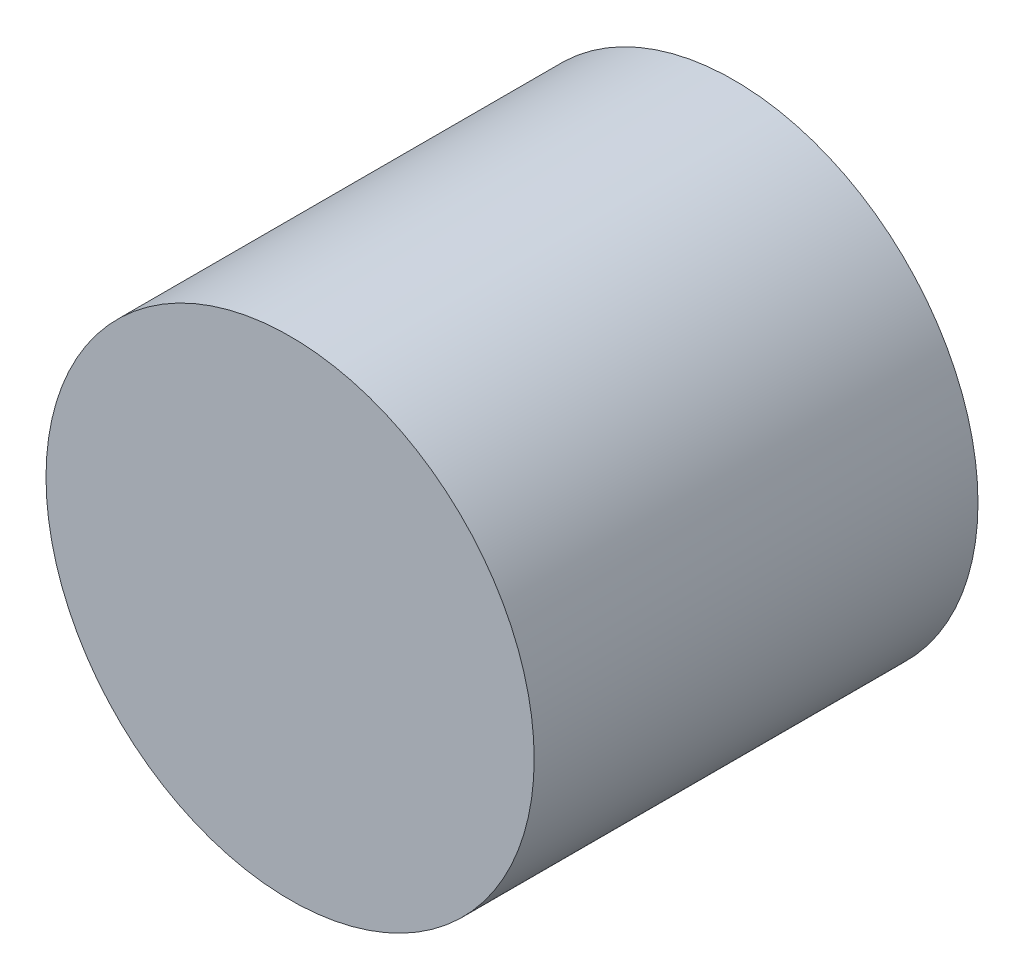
from build123d import *

# Parameters (mm, degrees)
ESQUISSE2_R      = 22
EXTRUSION1_DEPTH = 40


with BuildPart() as part:
    # Esquisse2 → Extrusion1 (new body)
    with BuildSketch(Plane(origin=(0, 0, -339), x_dir=(-1, 0, 0), z_dir=(0, 0, -1))):
        with Locations((17.491672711, -79.990623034)):
            Circle(ESQUISSE2_R)
    extrude(amount=-EXTRUSION1_DEPTH)


solid = part.part
